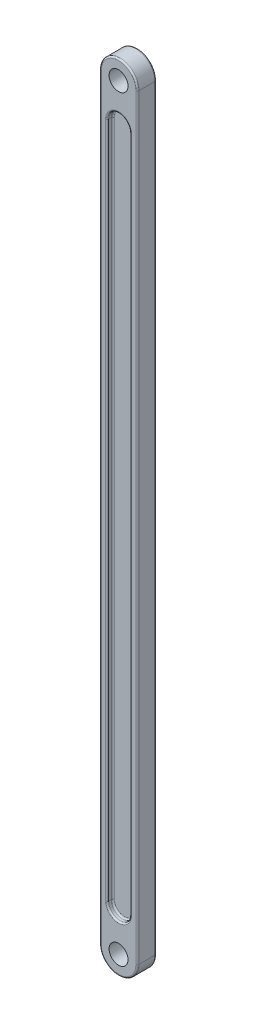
ISO-10303-21;
HEADER;
FILE_DESCRIPTION(('STEP AP214'),'2;1');
FILE_NAME('part.step','',(''),(''),'','','');
FILE_SCHEMA(('AUTOMOTIVE_DESIGN { 1 0 10303 214 1 1 1 1 }'));
ENDSEC;
DATA;
#1=APPLICATION_CONTEXT('core data for automotive mechanical design processes');
#2=APPLICATION_PROTOCOL_DEFINITION('international standard','automotive_design',2000,#1);
#3=PRODUCT_CONTEXT('',#1,'mechanical');
#4=PRODUCT('Part','Part','',(#3));
#5=PRODUCT_RELATED_PRODUCT_CATEGORY('part','',(#4));
#6=PRODUCT_DEFINITION_FORMATION('','',#4);
#7=PRODUCT_DEFINITION_CONTEXT('part definition',#1,'design');
#8=PRODUCT_DEFINITION('design','',#6,#7);
#9=PRODUCT_DEFINITION_SHAPE('','',#8);
#10=(LENGTH_UNIT() NAMED_UNIT(*) SI_UNIT(.MILLI.,.METRE.));
#11=(NAMED_UNIT(*) PLANE_ANGLE_UNIT() SI_UNIT($,.RADIAN.));
#12=(NAMED_UNIT(*) SI_UNIT($,.STERADIAN.) SOLID_ANGLE_UNIT());
#13=UNCERTAINTY_MEASURE_WITH_UNIT(LENGTH_MEASURE(1.E-05),#10,'distance_accuracy_value','');
#14=(GEOMETRIC_REPRESENTATION_CONTEXT(3) GLOBAL_UNCERTAINTY_ASSIGNED_CONTEXT((#13)) GLOBAL_UNIT_ASSIGNED_CONTEXT((#10,
#11,#12)) REPRESENTATION_CONTEXT('',''));
#15=CARTESIAN_POINT('',(0.,0.,0.));
#16=DIRECTION('',(0.,0.,1.));
#17=DIRECTION('',(1.,0.,0.));
#18=AXIS2_PLACEMENT_3D('',#15,#16,#17);
#19=CARTESIAN_POINT('',(0.,1000.,12.5));
#20=DIRECTION('',(0.,0.,1.));
#21=DIRECTION('',(1.,0.,0.));
#22=AXIS2_PLACEMENT_3D('',#19,#20,#21);
#23=PLANE('',#22);
#24=DIRECTION('',(0.,-1.,0.));
#25=VECTOR('',#24,1.);
#26=CARTESIAN_POINT('',(-17.,947.5,12.5));
#27=LINE('',#26,#25);
#28=CARTESIAN_POINT('',(-17.0000000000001,52.5000000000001,12.5));
#29=VERTEX_POINT('',#28);
#30=CARTESIAN_POINT('',(-17.,947.5,12.5));
#31=VERTEX_POINT('',#30);
#32=EDGE_CURVE('E294',#29,#31,#27,.F.);
#33=ORIENTED_EDGE('',*,*,#32,.T.);
#34=CARTESIAN_POINT('',(0.,947.5,12.5));
#35=DIRECTION('',(0.,0.,1.));
#36=DIRECTION('',(1.,0.,0.));
#37=AXIS2_PLACEMENT_3D('',#34,#35,#36);
#38=CIRCLE('',#37,17.0000000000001);
#39=CARTESIAN_POINT('',(17.0000000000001,947.5,12.5));
#40=VERTEX_POINT('',#39);
#41=EDGE_CURVE('E296',#31,#40,#38,.F.);
#42=ORIENTED_EDGE('',*,*,#41,.T.);
#43=DIRECTION('',(0.,-1.,0.));
#44=VECTOR('',#43,1.);
#45=CARTESIAN_POINT('',(17.0000000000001,1000.,12.5));
#46=LINE('',#45,#44);
#47=CARTESIAN_POINT('',(17.0000000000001,52.5000000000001,12.5));
#48=VERTEX_POINT('',#47);
#49=EDGE_CURVE('E290',#40,#48,#46,.T.);
#50=ORIENTED_EDGE('',*,*,#49,.T.);
#51=CARTESIAN_POINT('',(0.,52.5000000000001,12.5));
#52=DIRECTION('',(0.,0.,1.));
#53=DIRECTION('',(1.,0.,0.));
#54=AXIS2_PLACEMENT_3D('',#51,#52,#53);
#55=CIRCLE('',#54,17.0000000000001);
#56=EDGE_CURVE('E292',#48,#29,#55,.F.);
#57=ORIENTED_EDGE('',*,*,#56,.T.);
#58=EDGE_LOOP('',(#33,#42,#50,#57));
#59=FACE_BOUND('',#58,.T.);
#60=CARTESIAN_POINT('',(0.,1000.,12.5));
#61=DIRECTION('',(0.,0.,1.));
#62=DIRECTION('',(1.,0.,0.));
#63=AXIS2_PLACEMENT_3D('',#60,#61,#62);
#64=CIRCLE('',#63,12.5);
#65=CARTESIAN_POINT('',(12.5,1000.,12.5));
#66=VERTEX_POINT('',#65);
#67=EDGE_CURVE('E402',#66,#66,#64,.T.);
#68=ORIENTED_EDGE('',*,*,#67,.F.);
#69=EDGE_LOOP('',(#68));
#70=FACE_BOUND('',#69,.T.);
#71=CARTESIAN_POINT('',(0.,0.,12.5));
#72=DIRECTION('',(0.,0.,1.));
#73=DIRECTION('',(1.,0.,0.));
#74=AXIS2_PLACEMENT_3D('',#71,#72,#73);
#75=CIRCLE('',#74,12.5);
#76=CARTESIAN_POINT('',(12.5,0.,12.5));
#77=VERTEX_POINT('',#76);
#78=EDGE_CURVE('E408',#77,#77,#75,.T.);
#79=ORIENTED_EDGE('',*,*,#78,.F.);
#80=EDGE_LOOP('',(#79));
#81=FACE_BOUND('',#80,.T.);
#82=DIRECTION('',(0.,1.,0.));
#83=VECTOR('',#82,1.);
#84=CARTESIAN_POINT('',(23.,1000.,12.5));
#85=LINE('',#84,#83);
#86=CARTESIAN_POINT('',(23.,0.,12.5));
#87=VERTEX_POINT('',#86);
#88=CARTESIAN_POINT('',(23.,1000.,12.5));
#89=VERTEX_POINT('',#88);
#90=EDGE_CURVE('E220',#87,#89,#85,.T.);
#91=ORIENTED_EDGE('',*,*,#90,.T.);
#92=CARTESIAN_POINT('',(0.,1000.,12.5));
#93=DIRECTION('',(0.,0.,1.));
#94=DIRECTION('',(1.,0.,0.));
#95=AXIS2_PLACEMENT_3D('',#92,#93,#94);
#96=CIRCLE('',#95,23.);
#97=CARTESIAN_POINT('',(-23.0000000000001,1000.,12.5));
#98=VERTEX_POINT('',#97);
#99=EDGE_CURVE('E201',#89,#98,#96,.T.);
#100=ORIENTED_EDGE('',*,*,#99,.T.);
#101=DIRECTION('',(0.,-1.,0.));
#102=VECTOR('',#101,1.);
#103=CARTESIAN_POINT('',(-23.,0.,12.5));
#104=LINE('',#103,#102);
#105=CARTESIAN_POINT('',(-23.,0.,12.5));
#106=VERTEX_POINT('',#105);
#107=EDGE_CURVE('E210',#98,#106,#104,.T.);
#108=ORIENTED_EDGE('',*,*,#107,.T.);
#109=CARTESIAN_POINT('',(0.,0.,12.5));
#110=DIRECTION('',(0.,0.,1.));
#111=DIRECTION('',(1.,0.,0.));
#112=AXIS2_PLACEMENT_3D('',#109,#110,#111);
#113=CIRCLE('',#112,23.);
#114=EDGE_CURVE('E216',#106,#87,#113,.T.);
#115=ORIENTED_EDGE('',*,*,#114,.T.);
#116=EDGE_LOOP('',(#91,#100,#108,#115));
#117=FACE_BOUND('',#116,.T.);
#118=ADVANCED_FACE('F34',(#59,#70,#81,#117),#23,.T.);
#119=CARTESIAN_POINT('',(0.,1000.,-12.5));
#120=DIRECTION('',(0.,0.,1.));
#121=DIRECTION('',(1.,0.,0.));
#122=AXIS2_PLACEMENT_3D('',#119,#120,#121);
#123=PLANE('',#122);
#124=DIRECTION('',(0.,1.,0.));
#125=VECTOR('',#124,1.);
#126=CARTESIAN_POINT('',(-17.0000000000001,52.5000000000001,-12.5));
#127=LINE('',#126,#125);
#128=CARTESIAN_POINT('',(-17.,947.5,-12.5));
#129=VERTEX_POINT('',#128);
#130=CARTESIAN_POINT('',(-17.0000000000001,52.5000000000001,-12.5));
#131=VERTEX_POINT('',#130);
#132=EDGE_CURVE('E51',#129,#131,#127,.F.);
#133=ORIENTED_EDGE('',*,*,#132,.T.);
#134=CARTESIAN_POINT('',(0.,52.5000000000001,-12.5));
#135=DIRECTION('',(0.,0.,1.));
#136=DIRECTION('',(1.,0.,0.));
#137=AXIS2_PLACEMENT_3D('',#134,#135,#136);
#138=CIRCLE('',#137,17.0000000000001);
#139=CARTESIAN_POINT('',(17.0000000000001,52.5000000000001,-12.5));
#140=VERTEX_POINT('',#139);
#141=EDGE_CURVE('E326',#131,#140,#138,.T.);
#142=ORIENTED_EDGE('',*,*,#141,.T.);
#143=DIRECTION('',(0.,1.,0.));
#144=VECTOR('',#143,1.);
#145=CARTESIAN_POINT('',(17.0000000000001,1000.,-12.5));
#146=LINE('',#145,#144);
#147=CARTESIAN_POINT('',(17.0000000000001,947.5,-12.5));
#148=VERTEX_POINT('',#147);
#149=EDGE_CURVE('E322',#140,#148,#146,.T.);
#150=ORIENTED_EDGE('',*,*,#149,.T.);
#151=CARTESIAN_POINT('',(0.,947.5,-12.5));
#152=DIRECTION('',(0.,0.,1.));
#153=DIRECTION('',(1.,0.,0.));
#154=AXIS2_PLACEMENT_3D('',#151,#152,#153);
#155=CIRCLE('',#154,17.0000000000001);
#156=EDGE_CURVE('E56',#148,#129,#155,.T.);
#157=ORIENTED_EDGE('',*,*,#156,.T.);
#158=EDGE_LOOP('',(#133,#142,#150,#157));
#159=FACE_BOUND('',#158,.T.);
#160=DIRECTION('',(0.,-1.,0.));
#161=VECTOR('',#160,1.);
#162=CARTESIAN_POINT('',(-23.0000000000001,1000.,-12.5));
#163=LINE('',#162,#161);
#164=CARTESIAN_POINT('',(-23.,0.,-12.5));
#165=VERTEX_POINT('',#164);
#166=CARTESIAN_POINT('',(-23.0000000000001,1000.,-12.5));
#167=VERTEX_POINT('',#166);
#168=EDGE_CURVE('E238',#165,#167,#163,.F.);
#169=ORIENTED_EDGE('',*,*,#168,.T.);
#170=CARTESIAN_POINT('',(0.,1000.,-12.5));
#171=DIRECTION('',(0.,0.,1.));
#172=DIRECTION('',(1.,0.,0.));
#173=AXIS2_PLACEMENT_3D('',#170,#171,#172);
#174=CIRCLE('',#173,23.);
#175=CARTESIAN_POINT('',(23.,1000.,-12.5));
#176=VERTEX_POINT('',#175);
#177=EDGE_CURVE('E244',#167,#176,#174,.F.);
#178=ORIENTED_EDGE('',*,*,#177,.T.);
#179=DIRECTION('',(0.,1.,0.));
#180=VECTOR('',#179,1.);
#181=CARTESIAN_POINT('',(23.,1000.,-12.5));
#182=LINE('',#181,#180);
#183=CARTESIAN_POINT('',(23.,0.,-12.5));
#184=VERTEX_POINT('',#183);
#185=EDGE_CURVE('E242',#176,#184,#182,.F.);
#186=ORIENTED_EDGE('',*,*,#185,.T.);
#187=CARTESIAN_POINT('',(0.,0.,-12.5));
#188=DIRECTION('',(0.,0.,1.));
#189=DIRECTION('',(1.,0.,0.));
#190=AXIS2_PLACEMENT_3D('',#187,#188,#189);
#191=CIRCLE('',#190,23.);
#192=EDGE_CURVE('E240',#184,#165,#191,.F.);
#193=ORIENTED_EDGE('',*,*,#192,.T.);
#194=EDGE_LOOP('',(#169,#178,#186,#193));
#195=FACE_BOUND('',#194,.T.);
#196=CARTESIAN_POINT('',(0.,0.,-12.5));
#197=DIRECTION('',(0.,0.,1.));
#198=DIRECTION('',(1.,0.,0.));
#199=AXIS2_PLACEMENT_3D('',#196,#197,#198);
#200=CIRCLE('',#199,12.5);
#201=CARTESIAN_POINT('',(12.5,0.,-12.5));
#202=VERTEX_POINT('',#201);
#203=EDGE_CURVE('E405',#202,#202,#200,.T.);
#204=ORIENTED_EDGE('',*,*,#203,.T.);
#205=EDGE_LOOP('',(#204));
#206=FACE_BOUND('',#205,.T.);
#207=CARTESIAN_POINT('',(0.,1000.,-12.5));
#208=DIRECTION('',(0.,0.,1.));
#209=DIRECTION('',(1.,0.,0.));
#210=AXIS2_PLACEMENT_3D('',#207,#208,#209);
#211=CIRCLE('',#210,12.5);
#212=CARTESIAN_POINT('',(12.5,1000.,-12.5));
#213=VERTEX_POINT('',#212);
#214=EDGE_CURVE('E257',#213,#213,#211,.T.);
#215=ORIENTED_EDGE('',*,*,#214,.T.);
#216=EDGE_LOOP('',(#215));
#217=FACE_BOUND('',#216,.T.);
#218=ADVANCED_FACE('F463',(#159,#195,#206,#217),#123,.F.);
#219=CARTESIAN_POINT('',(0.,1000.,12.5));
#220=DIRECTION('',(0.,0.,-1.));
#221=DIRECTION('',(-1.,0.,0.));
#222=AXIS2_PLACEMENT_3D('',#219,#220,#221);
#223=CYLINDRICAL_SURFACE('',#222,25.);
#224=DIRECTION('',(0.,0.,-1.));
#225=VECTOR('',#224,1.);
#226=CARTESIAN_POINT('',(-25.0000000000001,1000.,12.5));
#227=LINE('',#226,#225);
#228=CARTESIAN_POINT('',(-25.0000000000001,1000.,10.5));
#229=VERTEX_POINT('',#228);
#230=CARTESIAN_POINT('',(-25.0000000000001,1000.,-10.5));
#231=VERTEX_POINT('',#230);
#232=EDGE_CURVE('E217',#229,#231,#227,.T.);
#233=ORIENTED_EDGE('',*,*,#232,.F.);
#234=CARTESIAN_POINT('',(0.,1000.,10.5));
#235=DIRECTION('',(0.,0.,1.));
#236=DIRECTION('',(1.,0.,0.));
#237=AXIS2_PLACEMENT_3D('',#234,#235,#236);
#238=CIRCLE('',#237,25.);
#239=CARTESIAN_POINT('',(25.,1000.,10.5));
#240=VERTEX_POINT('',#239);
#241=EDGE_CURVE('E203',#229,#240,#238,.F.);
#242=ORIENTED_EDGE('',*,*,#241,.T.);
#243=DIRECTION('',(0.,0.,-1.));
#244=VECTOR('',#243,1.);
#245=CARTESIAN_POINT('',(25.,1000.,12.5));
#246=LINE('',#245,#244);
#247=CARTESIAN_POINT('',(25.,1000.,-10.5));
#248=VERTEX_POINT('',#247);
#249=EDGE_CURVE('E411',#240,#248,#246,.T.);
#250=ORIENTED_EDGE('',*,*,#249,.T.);
#251=CARTESIAN_POINT('',(0.,1000.,-10.5));
#252=DIRECTION('',(0.,0.,1.));
#253=DIRECTION('',(1.,0.,0.));
#254=AXIS2_PLACEMENT_3D('',#251,#252,#253);
#255=CIRCLE('',#254,25.);
#256=EDGE_CURVE('E222',#248,#231,#255,.T.);
#257=ORIENTED_EDGE('',*,*,#256,.T.);
#258=EDGE_LOOP('',(#233,#242,#250,#257));
#259=FACE_BOUND('',#258,.T.);
#260=ADVANCED_FACE('F435',(#259),#223,.T.);
#261=CARTESIAN_POINT('',(-25.0000000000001,1000.,12.5));
#262=DIRECTION('',(1.,0.,0.));
#263=DIRECTION('',(0.,1.,0.));
#264=AXIS2_PLACEMENT_3D('',#261,#262,#263);
#265=PLANE('',#264);
#266=DIRECTION('',(0.,0.,-1.));
#267=VECTOR('',#266,1.);
#268=CARTESIAN_POINT('',(-25.,0.,12.5));
#269=LINE('',#268,#267);
#270=CARTESIAN_POINT('',(-25.,0.,10.5));
#271=VERTEX_POINT('',#270);
#272=CARTESIAN_POINT('',(-25.,0.,-10.5));
#273=VERTEX_POINT('',#272);
#274=EDGE_CURVE('E419',#271,#273,#269,.T.);
#275=ORIENTED_EDGE('',*,*,#274,.F.);
#276=DIRECTION('',(0.,-1.,0.));
#277=VECTOR('',#276,1.);
#278=CARTESIAN_POINT('',(-25.0000000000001,1000.,10.5));
#279=LINE('',#278,#277);
#280=EDGE_CURVE('E249',#271,#229,#279,.F.);
#281=ORIENTED_EDGE('',*,*,#280,.T.);
#282=ORIENTED_EDGE('',*,*,#232,.T.);
#283=DIRECTION('',(0.,-1.,0.));
#284=VECTOR('',#283,1.);
#285=CARTESIAN_POINT('',(-25.0000000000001,1000.,-10.5));
#286=LINE('',#285,#284);
#287=EDGE_CURVE('E247',#231,#273,#286,.T.);
#288=ORIENTED_EDGE('',*,*,#287,.T.);
#289=EDGE_LOOP('',(#275,#281,#282,#288));
#290=FACE_BOUND('',#289,.T.);
#291=ADVANCED_FACE('F451',(#290),#265,.F.);
#292=CARTESIAN_POINT('',(0.,0.,12.5));
#293=DIRECTION('',(0.,0.,-1.));
#294=DIRECTION('',(-1.,0.,0.));
#295=AXIS2_PLACEMENT_3D('',#292,#293,#294);
#296=CYLINDRICAL_SURFACE('',#295,25.);
#297=DIRECTION('',(0.,0.,-1.));
#298=VECTOR('',#297,1.);
#299=CARTESIAN_POINT('',(25.,0.,12.5));
#300=LINE('',#299,#298);
#301=CARTESIAN_POINT('',(25.,0.,10.5));
#302=VERTEX_POINT('',#301);
#303=CARTESIAN_POINT('',(25.,0.,-10.5));
#304=VERTEX_POINT('',#303);
#305=EDGE_CURVE('E416',#302,#304,#300,.T.);
#306=ORIENTED_EDGE('',*,*,#305,.F.);
#307=CARTESIAN_POINT('',(0.,0.,10.5));
#308=DIRECTION('',(0.,0.,1.));
#309=DIRECTION('',(1.,0.,0.));
#310=AXIS2_PLACEMENT_3D('',#307,#308,#309);
#311=CIRCLE('',#310,25.);
#312=EDGE_CURVE('E236',#302,#271,#311,.F.);
#313=ORIENTED_EDGE('',*,*,#312,.T.);
#314=ORIENTED_EDGE('',*,*,#274,.T.);
#315=CARTESIAN_POINT('',(0.,0.,-10.5));
#316=DIRECTION('',(0.,0.,1.));
#317=DIRECTION('',(1.,0.,0.));
#318=AXIS2_PLACEMENT_3D('',#315,#316,#317);
#319=CIRCLE('',#318,25.);
#320=EDGE_CURVE('E234',#273,#304,#319,.T.);
#321=ORIENTED_EDGE('',*,*,#320,.T.);
#322=EDGE_LOOP('',(#306,#313,#314,#321));
#323=FACE_BOUND('',#322,.T.);
#324=ADVANCED_FACE('F454',(#323),#296,.T.);
#325=CARTESIAN_POINT('',(25.,1000.,12.5));
#326=DIRECTION('',(-1.,0.,0.));
#327=DIRECTION('',(0.,-1.,0.));
#328=AXIS2_PLACEMENT_3D('',#325,#326,#327);
#329=PLANE('',#328);
#330=ORIENTED_EDGE('',*,*,#249,.F.);
#331=DIRECTION('',(0.,1.,0.));
#332=VECTOR('',#331,1.);
#333=CARTESIAN_POINT('',(25.,0.,10.5));
#334=LINE('',#333,#332);
#335=EDGE_CURVE('E232',#240,#302,#334,.F.);
#336=ORIENTED_EDGE('',*,*,#335,.T.);
#337=ORIENTED_EDGE('',*,*,#305,.T.);
#338=DIRECTION('',(0.,1.,0.));
#339=VECTOR('',#338,1.);
#340=CARTESIAN_POINT('',(25.,1000.,-10.5));
#341=LINE('',#340,#339);
#342=EDGE_CURVE('E230',#304,#248,#341,.T.);
#343=ORIENTED_EDGE('',*,*,#342,.T.);
#344=EDGE_LOOP('',(#330,#336,#337,#343));
#345=FACE_BOUND('',#344,.T.);
#346=ADVANCED_FACE('F437',(#345),#329,.F.);
#347=CARTESIAN_POINT('',(0.,0.,12.5));
#348=DIRECTION('',(0.,0.,-1.));
#349=DIRECTION('',(-1.,0.,0.));
#350=AXIS2_PLACEMENT_3D('',#347,#348,#349);
#351=CYLINDRICAL_SURFACE('',#350,12.5);
#352=ORIENTED_EDGE('',*,*,#78,.T.);
#353=EDGE_LOOP('',(#352));
#354=FACE_BOUND('',#353,.T.);
#355=ORIENTED_EDGE('',*,*,#203,.F.);
#356=EDGE_LOOP('',(#355));
#357=FACE_BOUND('',#356,.T.);
#358=ADVANCED_FACE('F473',(#354,#357),#351,.F.);
#359=CARTESIAN_POINT('',(0.,1000.,12.5));
#360=DIRECTION('',(0.,0.,-1.));
#361=DIRECTION('',(-1.,0.,0.));
#362=AXIS2_PLACEMENT_3D('',#359,#360,#361);
#363=CYLINDRICAL_SURFACE('',#362,12.5);
#364=ORIENTED_EDGE('',*,*,#67,.T.);
#365=EDGE_LOOP('',(#364));
#366=FACE_BOUND('',#365,.T.);
#367=ORIENTED_EDGE('',*,*,#214,.F.);
#368=EDGE_LOOP('',(#367));
#369=FACE_BOUND('',#368,.T.);
#370=ADVANCED_FACE('F471',(#366,#369),#363,.F.);
#371=CARTESIAN_POINT('',(0.,0.,10.5));
#372=DIRECTION('',(0.,0.,1.));
#373=DIRECTION('',(1.,0.,0.));
#374=AXIS2_PLACEMENT_3D('',#371,#372,#373);
#375=TOROIDAL_SURFACE('',#374,23.,2.);
#376=CARTESIAN_POINT('',(-23.,0.,10.5));
#377=DIRECTION('',(0.,1.,0.));
#378=DIRECTION('',(-1.,0.,0.));
#379=AXIS2_PLACEMENT_3D('',#376,#377,#378);
#380=CIRCLE('',#379,2.);
#381=EDGE_CURVE('E213',#271,#106,#380,.T.);
#382=ORIENTED_EDGE('',*,*,#381,.F.);
#383=ORIENTED_EDGE('',*,*,#312,.F.);
#384=CARTESIAN_POINT('',(23.,0.,10.5));
#385=DIRECTION('',(0.,1.,0.));
#386=DIRECTION('',(-1.,0.,0.));
#387=AXIS2_PLACEMENT_3D('',#384,#385,#386);
#388=CIRCLE('',#387,2.);
#389=EDGE_CURVE('E254',#87,#302,#388,.T.);
#390=ORIENTED_EDGE('',*,*,#389,.F.);
#391=ORIENTED_EDGE('',*,*,#114,.F.);
#392=EDGE_LOOP('',(#382,#383,#390,#391));
#393=FACE_BOUND('',#392,.T.);
#394=ADVANCED_FACE('F426',(#393),#375,.T.);
#395=CARTESIAN_POINT('',(23.,1000.,10.5));
#396=DIRECTION('',(0.,-1.,0.));
#397=DIRECTION('',(1.,0.,0.));
#398=AXIS2_PLACEMENT_3D('',#395,#396,#397);
#399=CYLINDRICAL_SURFACE('',#398,2.);
#400=ORIENTED_EDGE('',*,*,#389,.T.);
#401=ORIENTED_EDGE('',*,*,#335,.F.);
#402=CARTESIAN_POINT('',(23.,1000.,10.5));
#403=DIRECTION('',(0.,1.,0.));
#404=DIRECTION('',(0.,0.,1.));
#405=AXIS2_PLACEMENT_3D('',#402,#403,#404);
#406=CIRCLE('',#405,2.);
#407=EDGE_CURVE('E206',#89,#240,#406,.T.);
#408=ORIENTED_EDGE('',*,*,#407,.F.);
#409=ORIENTED_EDGE('',*,*,#90,.F.);
#410=EDGE_LOOP('',(#400,#401,#408,#409));
#411=FACE_BOUND('',#410,.T.);
#412=ADVANCED_FACE('F429',(#411),#399,.T.);
#413=CARTESIAN_POINT('',(-23.0000000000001,1000.,10.5));
#414=DIRECTION('',(0.,1.,0.));
#415=DIRECTION('',(-1.,0.,0.));
#416=AXIS2_PLACEMENT_3D('',#413,#414,#415);
#417=CYLINDRICAL_SURFACE('',#416,2.);
#418=ORIENTED_EDGE('',*,*,#381,.T.);
#419=ORIENTED_EDGE('',*,*,#107,.F.);
#420=CARTESIAN_POINT('',(-23.0000000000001,1000.,10.5));
#421=DIRECTION('',(0.,1.,0.));
#422=DIRECTION('',(0.,0.,1.));
#423=AXIS2_PLACEMENT_3D('',#420,#421,#422);
#424=CIRCLE('',#423,2.);
#425=EDGE_CURVE('E197',#229,#98,#424,.T.);
#426=ORIENTED_EDGE('',*,*,#425,.F.);
#427=ORIENTED_EDGE('',*,*,#280,.F.);
#428=EDGE_LOOP('',(#418,#419,#426,#427));
#429=FACE_BOUND('',#428,.T.);
#430=ADVANCED_FACE('F211',(#429),#417,.T.);
#431=CARTESIAN_POINT('',(0.,1000.,10.5));
#432=DIRECTION('',(0.,0.,1.));
#433=DIRECTION('',(1.,0.,0.));
#434=AXIS2_PLACEMENT_3D('',#431,#432,#433);
#435=TOROIDAL_SURFACE('',#434,23.,2.);
#436=ORIENTED_EDGE('',*,*,#407,.T.);
#437=ORIENTED_EDGE('',*,*,#241,.F.);
#438=ORIENTED_EDGE('',*,*,#425,.T.);
#439=ORIENTED_EDGE('',*,*,#99,.F.);
#440=EDGE_LOOP('',(#436,#437,#438,#439));
#441=FACE_BOUND('',#440,.T.);
#442=ADVANCED_FACE('F199',(#441),#435,.T.);
#443=CARTESIAN_POINT('',(0.,0.,-10.5));
#444=DIRECTION('',(0.,0.,1.));
#445=DIRECTION('',(1.,0.,0.));
#446=AXIS2_PLACEMENT_3D('',#443,#444,#445);
#447=TOROIDAL_SURFACE('',#446,23.,2.);
#448=CARTESIAN_POINT('',(-23.,0.,-10.5));
#449=DIRECTION('',(0.,1.,0.));
#450=DIRECTION('',(-1.,0.,0.));
#451=AXIS2_PLACEMENT_3D('',#448,#449,#450);
#452=CIRCLE('',#451,2.);
#453=EDGE_CURVE('E263',#165,#273,#452,.T.);
#454=ORIENTED_EDGE('',*,*,#453,.F.);
#455=ORIENTED_EDGE('',*,*,#192,.F.);
#456=CARTESIAN_POINT('',(23.,0.,-10.5));
#457=DIRECTION('',(0.,1.,0.));
#458=DIRECTION('',(0.,0.,1.));
#459=AXIS2_PLACEMENT_3D('',#456,#457,#458);
#460=CIRCLE('',#459,2.);
#461=EDGE_CURVE('E207',#304,#184,#460,.T.);
#462=ORIENTED_EDGE('',*,*,#461,.F.);
#463=ORIENTED_EDGE('',*,*,#320,.F.);
#464=EDGE_LOOP('',(#454,#455,#462,#463));
#465=FACE_BOUND('',#464,.T.);
#466=ADVANCED_FACE('F457',(#465),#447,.T.);
#467=CARTESIAN_POINT('',(23.,1000.,-10.5));
#468=DIRECTION('',(0.,1.,0.));
#469=DIRECTION('',(-1.,0.,0.));
#470=AXIS2_PLACEMENT_3D('',#467,#468,#469);
#471=CYLINDRICAL_SURFACE('',#470,2.);
#472=ORIENTED_EDGE('',*,*,#461,.T.);
#473=ORIENTED_EDGE('',*,*,#185,.F.);
#474=CARTESIAN_POINT('',(23.,1000.,-10.5));
#475=DIRECTION('',(0.,1.,0.));
#476=DIRECTION('',(0.,0.,1.));
#477=AXIS2_PLACEMENT_3D('',#474,#475,#476);
#478=CIRCLE('',#477,2.);
#479=EDGE_CURVE('E260',#248,#176,#478,.T.);
#480=ORIENTED_EDGE('',*,*,#479,.F.);
#481=ORIENTED_EDGE('',*,*,#342,.F.);
#482=EDGE_LOOP('',(#472,#473,#480,#481));
#483=FACE_BOUND('',#482,.T.);
#484=ADVANCED_FACE('F441',(#483),#471,.T.);
#485=CARTESIAN_POINT('',(-23.0000000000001,1000.,-10.5));
#486=DIRECTION('',(0.,-1.,0.));
#487=DIRECTION('',(1.,0.,0.));
#488=AXIS2_PLACEMENT_3D('',#485,#486,#487);
#489=CYLINDRICAL_SURFACE('',#488,2.);
#490=ORIENTED_EDGE('',*,*,#453,.T.);
#491=ORIENTED_EDGE('',*,*,#287,.F.);
#492=CARTESIAN_POINT('',(-23.0000000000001,1000.,-10.5));
#493=DIRECTION('',(0.,1.,0.));
#494=DIRECTION('',(0.,0.,1.));
#495=AXIS2_PLACEMENT_3D('',#492,#493,#494);
#496=CIRCLE('',#495,2.);
#497=EDGE_CURVE('E258',#167,#231,#496,.T.);
#498=ORIENTED_EDGE('',*,*,#497,.F.);
#499=ORIENTED_EDGE('',*,*,#168,.F.);
#500=EDGE_LOOP('',(#490,#491,#498,#499));
#501=FACE_BOUND('',#500,.T.);
#502=ADVANCED_FACE('F461',(#501),#489,.T.);
#503=CARTESIAN_POINT('',(0.,1000.,-10.5));
#504=DIRECTION('',(0.,0.,1.));
#505=DIRECTION('',(1.,0.,0.));
#506=AXIS2_PLACEMENT_3D('',#503,#504,#505);
#507=TOROIDAL_SURFACE('',#506,23.,2.);
#508=ORIENTED_EDGE('',*,*,#479,.T.);
#509=ORIENTED_EDGE('',*,*,#177,.F.);
#510=ORIENTED_EDGE('',*,*,#497,.T.);
#511=ORIENTED_EDGE('',*,*,#256,.F.);
#512=EDGE_LOOP('',(#508,#509,#510,#511));
#513=FACE_BOUND('',#512,.T.);
#514=ADVANCED_FACE('F446',(#513),#507,.T.);
#515=CARTESIAN_POINT('',(0.,947.5,-5.));
#516=DIRECTION('',(0.,0.,-1.));
#517=DIRECTION('',(-1.,0.,0.));
#518=AXIS2_PLACEMENT_3D('',#515,#516,#517);
#519=CYLINDRICAL_SURFACE('',#518,15.0000000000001);
#520=DIRECTION('',(0.,0.,-1.));
#521=VECTOR('',#520,1.);
#522=CARTESIAN_POINT('',(15.0000000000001,947.5,-5.));
#523=LINE('',#522,#521);
#524=CARTESIAN_POINT('',(15.0000000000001,947.5,-7.));
#525=VERTEX_POINT('',#524);
#526=CARTESIAN_POINT('',(15.0000000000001,947.5,-10.5));
#527=VERTEX_POINT('',#526);
#528=EDGE_CURVE('E384',#525,#527,#523,.T.);
#529=ORIENTED_EDGE('',*,*,#528,.F.);
#530=CARTESIAN_POINT('',(0.,947.5,-7.));
#531=DIRECTION('',(0.,0.,-1.));
#532=DIRECTION('',(-1.,0.,0.));
#533=AXIS2_PLACEMENT_3D('',#530,#531,#532);
#534=CIRCLE('',#533,15.0000000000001);
#535=CARTESIAN_POINT('',(-15.,947.5,-7.));
#536=VERTEX_POINT('',#535);
#537=EDGE_CURVE('E310',#525,#536,#534,.F.);
#538=ORIENTED_EDGE('',*,*,#537,.T.);
#539=DIRECTION('',(0.,0.,-1.));
#540=VECTOR('',#539,1.);
#541=CARTESIAN_POINT('',(-15.,947.5,-5.));
#542=LINE('',#541,#540);
#543=CARTESIAN_POINT('',(-15.,947.5,-10.5));
#544=VERTEX_POINT('',#543);
#545=EDGE_CURVE('E261',#536,#544,#542,.T.);
#546=ORIENTED_EDGE('',*,*,#545,.T.);
#547=CARTESIAN_POINT('',(0.,947.5,-10.5));
#548=DIRECTION('',(0.,0.,1.));
#549=DIRECTION('',(1.,0.,0.));
#550=AXIS2_PLACEMENT_3D('',#547,#548,#549);
#551=CIRCLE('',#550,15.0000000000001);
#552=EDGE_CURVE('E308',#544,#527,#551,.F.);
#553=ORIENTED_EDGE('',*,*,#552,.T.);
#554=EDGE_LOOP('',(#529,#538,#546,#553));
#555=FACE_BOUND('',#554,.T.);
#556=ADVANCED_FACE('F383',(#555),#519,.F.);
#557=CARTESIAN_POINT('',(-15.,947.5,-5.));
#558=DIRECTION('',(1.,0.,0.));
#559=DIRECTION('',(0.,1.,0.));
#560=AXIS2_PLACEMENT_3D('',#557,#558,#559);
#561=PLANE('',#560);
#562=ORIENTED_EDGE('',*,*,#545,.F.);
#563=DIRECTION('',(0.,-1.,0.));
#564=VECTOR('',#563,1.);
#565=CARTESIAN_POINT('',(-15.0000000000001,52.5000000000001,-7.));
#566=LINE('',#565,#564);
#567=CARTESIAN_POINT('',(-15.0000000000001,52.5000000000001,-7.));
#568=VERTEX_POINT('',#567);
#569=EDGE_CURVE('E315',#536,#568,#566,.T.);
#570=ORIENTED_EDGE('',*,*,#569,.T.);
#571=DIRECTION('',(0.,0.,-1.));
#572=VECTOR('',#571,1.);
#573=CARTESIAN_POINT('',(-15.0000000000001,52.5000000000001,-5.));
#574=LINE('',#573,#572);
#575=CARTESIAN_POINT('',(-15.0000000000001,52.5000000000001,-10.5));
#576=VERTEX_POINT('',#575);
#577=EDGE_CURVE('E395',#568,#576,#574,.T.);
#578=ORIENTED_EDGE('',*,*,#577,.T.);
#579=DIRECTION('',(0.,1.,0.));
#580=VECTOR('',#579,1.);
#581=CARTESIAN_POINT('',(-15.,947.5,-10.5));
#582=LINE('',#581,#580);
#583=EDGE_CURVE('E313',#576,#544,#582,.T.);
#584=ORIENTED_EDGE('',*,*,#583,.T.);
#585=EDGE_LOOP('',(#562,#570,#578,#584));
#586=FACE_BOUND('',#585,.T.);
#587=ADVANCED_FACE('F682',(#586),#561,.T.);
#588=CARTESIAN_POINT('',(0.,52.5000000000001,-5.));
#589=DIRECTION('',(0.,0.,-1.));
#590=DIRECTION('',(-1.,0.,0.));
#591=AXIS2_PLACEMENT_3D('',#588,#589,#590);
#592=CYLINDRICAL_SURFACE('',#591,15.0000000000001);
#593=ORIENTED_EDGE('',*,*,#577,.F.);
#594=CARTESIAN_POINT('',(0.,52.5000000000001,-7.));
#595=DIRECTION('',(0.,0.,-1.));
#596=DIRECTION('',(-1.,0.,0.));
#597=AXIS2_PLACEMENT_3D('',#594,#595,#596);
#598=CIRCLE('',#597,15.0000000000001);
#599=CARTESIAN_POINT('',(15.0000000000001,52.5000000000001,-7.));
#600=VERTEX_POINT('',#599);
#601=EDGE_CURVE('E320',#568,#600,#598,.F.);
#602=ORIENTED_EDGE('',*,*,#601,.T.);
#603=DIRECTION('',(0.,0.,-1.));
#604=VECTOR('',#603,1.);
#605=CARTESIAN_POINT('',(15.0000000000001,52.5000000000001,-5.));
#606=LINE('',#605,#604);
#607=CARTESIAN_POINT('',(15.0000000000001,52.5000000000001,-10.5));
#608=VERTEX_POINT('',#607);
#609=EDGE_CURVE('E392',#600,#608,#606,.T.);
#610=ORIENTED_EDGE('',*,*,#609,.T.);
#611=CARTESIAN_POINT('',(0.,52.5000000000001,-10.5));
#612=DIRECTION('',(0.,0.,1.));
#613=DIRECTION('',(1.,0.,0.));
#614=AXIS2_PLACEMENT_3D('',#611,#612,#613);
#615=CIRCLE('',#614,15.0000000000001);
#616=EDGE_CURVE('E317',#608,#576,#615,.F.);
#617=ORIENTED_EDGE('',*,*,#616,.T.);
#618=EDGE_LOOP('',(#593,#602,#610,#617));
#619=FACE_BOUND('',#618,.T.);
#620=ADVANCED_FACE('F675',(#619),#592,.F.);
#621=CARTESIAN_POINT('',(15.0000000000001,947.5,-5.));
#622=DIRECTION('',(1.,0.,0.));
#623=DIRECTION('',(0.,1.,0.));
#624=AXIS2_PLACEMENT_3D('',#621,#622,#623);
#625=PLANE('',#624);
#626=ORIENTED_EDGE('',*,*,#609,.F.);
#627=DIRECTION('',(0.,-1.,0.));
#628=VECTOR('',#627,1.);
#629=CARTESIAN_POINT('',(15.0000000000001,947.5,-7.));
#630=LINE('',#629,#628);
#631=EDGE_CURVE('E11',#600,#525,#630,.F.);
#632=ORIENTED_EDGE('',*,*,#631,.T.);
#633=ORIENTED_EDGE('',*,*,#528,.T.);
#634=DIRECTION('',(0.,1.,0.));
#635=VECTOR('',#634,1.);
#636=CARTESIAN_POINT('',(15.0000000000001,947.5,-10.5));
#637=LINE('',#636,#635);
#638=EDGE_CURVE('E43',#527,#608,#637,.F.);
#639=ORIENTED_EDGE('',*,*,#638,.T.);
#640=EDGE_LOOP('',(#626,#632,#633,#639));
#641=FACE_BOUND('',#640,.T.);
#642=ADVANCED_FACE('F389',(#641),#625,.F.);
#643=CARTESIAN_POINT('',(0.,947.5,-5.));
#644=DIRECTION('',(0.,0.,-1.));
#645=DIRECTION('',(-1.,0.,0.));
#646=AXIS2_PLACEMENT_3D('',#643,#644,#645);
#647=PLANE('',#646);
#648=DIRECTION('',(0.,-1.,0.));
#649=VECTOR('',#648,1.);
#650=CARTESIAN_POINT('',(-13.,947.5,-5.));
#651=LINE('',#650,#649);
#652=CARTESIAN_POINT('',(-13.0000000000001,52.5000000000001,-5.));
#653=VERTEX_POINT('',#652);
#654=CARTESIAN_POINT('',(-13.,947.5,-5.));
#655=VERTEX_POINT('',#654);
#656=EDGE_CURVE('E303',#653,#655,#651,.F.);
#657=ORIENTED_EDGE('',*,*,#656,.T.);
#658=CARTESIAN_POINT('',(0.,947.5,-5.));
#659=DIRECTION('',(0.,0.,-1.));
#660=DIRECTION('',(-1.,0.,0.));
#661=AXIS2_PLACEMENT_3D('',#658,#659,#660);
#662=CIRCLE('',#661,13.0000000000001);
#663=CARTESIAN_POINT('',(13.0000000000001,947.5,-5.));
#664=VERTEX_POINT('',#663);
#665=EDGE_CURVE('E305',#655,#664,#662,.T.);
#666=ORIENTED_EDGE('',*,*,#665,.T.);
#667=DIRECTION('',(0.,-1.,0.));
#668=VECTOR('',#667,1.);
#669=CARTESIAN_POINT('',(13.0000000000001,947.5,-5.));
#670=LINE('',#669,#668);
#671=CARTESIAN_POINT('',(13.0000000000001,52.5000000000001,-5.));
#672=VERTEX_POINT('',#671);
#673=EDGE_CURVE('E299',#664,#672,#670,.T.);
#674=ORIENTED_EDGE('',*,*,#673,.T.);
#675=CARTESIAN_POINT('',(0.,52.5000000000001,-5.));
#676=DIRECTION('',(0.,0.,-1.));
#677=DIRECTION('',(-1.,0.,0.));
#678=AXIS2_PLACEMENT_3D('',#675,#676,#677);
#679=CIRCLE('',#678,13.0000000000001);
#680=EDGE_CURVE('E301',#672,#653,#679,.T.);
#681=ORIENTED_EDGE('',*,*,#680,.T.);
#682=EDGE_LOOP('',(#657,#666,#674,#681));
#683=FACE_BOUND('',#682,.T.);
#684=ADVANCED_FACE('F660',(#683),#647,.T.);
#685=CARTESIAN_POINT('',(0.,947.5,5.));
#686=DIRECTION('',(0.,0.,1.));
#687=DIRECTION('',(1.,0.,0.));
#688=AXIS2_PLACEMENT_3D('',#685,#686,#687);
#689=CYLINDRICAL_SURFACE('',#688,15.0000000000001);
#690=DIRECTION('',(0.,0.,1.));
#691=VECTOR('',#690,1.);
#692=CARTESIAN_POINT('',(-15.,947.5,5.));
#693=LINE('',#692,#691);
#694=CARTESIAN_POINT('',(-15.,947.5,7.));
#695=VERTEX_POINT('',#694);
#696=CARTESIAN_POINT('',(-15.,947.5,10.5));
#697=VERTEX_POINT('',#696);
#698=EDGE_CURVE('E344',#695,#697,#693,.T.);
#699=ORIENTED_EDGE('',*,*,#698,.F.);
#700=CARTESIAN_POINT('',(0.,947.5,7.));
#701=DIRECTION('',(0.,0.,1.));
#702=DIRECTION('',(1.,0.,0.));
#703=AXIS2_PLACEMENT_3D('',#700,#701,#702);
#704=CIRCLE('',#703,15.0000000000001);
#705=CARTESIAN_POINT('',(15.0000000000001,947.5,7.));
#706=VERTEX_POINT('',#705);
#707=EDGE_CURVE('E270',#695,#706,#704,.F.);
#708=ORIENTED_EDGE('',*,*,#707,.T.);
#709=DIRECTION('',(0.,0.,1.));
#710=VECTOR('',#709,1.);
#711=CARTESIAN_POINT('',(15.0000000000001,947.5,5.));
#712=LINE('',#711,#710);
#713=CARTESIAN_POINT('',(15.0000000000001,947.5,10.5));
#714=VERTEX_POINT('',#713);
#715=EDGE_CURVE('E393',#706,#714,#712,.T.);
#716=ORIENTED_EDGE('',*,*,#715,.T.);
#717=CARTESIAN_POINT('',(0.,947.5,10.5));
#718=DIRECTION('',(0.,0.,1.));
#719=DIRECTION('',(1.,0.,0.));
#720=AXIS2_PLACEMENT_3D('',#717,#718,#719);
#721=CIRCLE('',#720,15.0000000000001);
#722=EDGE_CURVE('E250',#714,#697,#721,.T.);
#723=ORIENTED_EDGE('',*,*,#722,.T.);
#724=EDGE_LOOP('',(#699,#708,#716,#723));
#725=FACE_BOUND('',#724,.T.);
#726=ADVANCED_FACE('F652',(#725),#689,.F.);
#727=CARTESIAN_POINT('',(15.0000000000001,947.5,5.));
#728=DIRECTION('',(-1.,0.,0.));
#729=DIRECTION('',(0.,-1.,0.));
#730=AXIS2_PLACEMENT_3D('',#727,#728,#729);
#731=PLANE('',#730);
#732=ORIENTED_EDGE('',*,*,#715,.F.);
#733=DIRECTION('',(0.,-1.,0.));
#734=VECTOR('',#733,1.);
#735=CARTESIAN_POINT('',(15.0000000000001,52.5000000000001,7.));
#736=LINE('',#735,#734);
#737=CARTESIAN_POINT('',(15.0000000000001,52.5000000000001,7.));
#738=VERTEX_POINT('',#737);
#739=EDGE_CURVE('E330',#706,#738,#736,.T.);
#740=ORIENTED_EDGE('',*,*,#739,.T.);
#741=DIRECTION('',(0.,0.,1.));
#742=VECTOR('',#741,1.);
#743=CARTESIAN_POINT('',(15.0000000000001,52.5000000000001,5.));
#744=LINE('',#743,#742);
#745=CARTESIAN_POINT('',(15.0000000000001,52.5000000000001,10.5));
#746=VERTEX_POINT('',#745);
#747=EDGE_CURVE('E398',#738,#746,#744,.T.);
#748=ORIENTED_EDGE('',*,*,#747,.T.);
#749=DIRECTION('',(0.,-1.,0.));
#750=VECTOR('',#749,1.);
#751=CARTESIAN_POINT('',(15.0000000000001,947.5,10.5));
#752=LINE('',#751,#750);
#753=EDGE_CURVE('E328',#746,#714,#752,.F.);
#754=ORIENTED_EDGE('',*,*,#753,.T.);
#755=EDGE_LOOP('',(#732,#740,#748,#754));
#756=FACE_BOUND('',#755,.T.);
#757=ADVANCED_FACE('F644',(#756),#731,.T.);
#758=CARTESIAN_POINT('',(0.,52.5000000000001,5.));
#759=DIRECTION('',(0.,0.,1.));
#760=DIRECTION('',(1.,0.,0.));
#761=AXIS2_PLACEMENT_3D('',#758,#759,#760);
#762=CYLINDRICAL_SURFACE('',#761,15.0000000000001);
#763=ORIENTED_EDGE('',*,*,#747,.F.);
#764=CARTESIAN_POINT('',(0.,52.5000000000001,7.));
#765=DIRECTION('',(0.,0.,1.));
#766=DIRECTION('',(1.,0.,0.));
#767=AXIS2_PLACEMENT_3D('',#764,#765,#766);
#768=CIRCLE('',#767,15.0000000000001);
#769=CARTESIAN_POINT('',(-15.0000000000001,52.5000000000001,7.));
#770=VERTEX_POINT('',#769);
#771=EDGE_CURVE('E288',#738,#770,#768,.F.);
#772=ORIENTED_EDGE('',*,*,#771,.T.);
#773=DIRECTION('',(0.,0.,1.));
#774=VECTOR('',#773,1.);
#775=CARTESIAN_POINT('',(-15.0000000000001,52.5000000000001,5.));
#776=LINE('',#775,#774);
#777=CARTESIAN_POINT('',(-15.0000000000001,52.5000000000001,10.5));
#778=VERTEX_POINT('',#777);
#779=EDGE_CURVE('E859',#770,#778,#776,.T.);
#780=ORIENTED_EDGE('',*,*,#779,.T.);
#781=CARTESIAN_POINT('',(0.,52.5000000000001,10.5));
#782=DIRECTION('',(0.,0.,1.));
#783=DIRECTION('',(1.,0.,0.));
#784=AXIS2_PLACEMENT_3D('',#781,#782,#783);
#785=CIRCLE('',#784,15.0000000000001);
#786=EDGE_CURVE('E286',#778,#746,#785,.T.);
#787=ORIENTED_EDGE('',*,*,#786,.T.);
#788=EDGE_LOOP('',(#763,#772,#780,#787));
#789=FACE_BOUND('',#788,.T.);
#790=ADVANCED_FACE('F636',(#789),#762,.F.);
#791=CARTESIAN_POINT('',(-15.,947.5,5.));
#792=DIRECTION('',(-1.,0.,0.));
#793=DIRECTION('',(0.,-1.,0.));
#794=AXIS2_PLACEMENT_3D('',#791,#792,#793);
#795=PLANE('',#794);
#796=ORIENTED_EDGE('',*,*,#779,.F.);
#797=DIRECTION('',(0.,-1.,0.));
#798=VECTOR('',#797,1.);
#799=CARTESIAN_POINT('',(-15.,947.5,7.));
#800=LINE('',#799,#798);
#801=EDGE_CURVE('E284',#770,#695,#800,.F.);
#802=ORIENTED_EDGE('',*,*,#801,.T.);
#803=ORIENTED_EDGE('',*,*,#698,.T.);
#804=DIRECTION('',(0.,-1.,0.));
#805=VECTOR('',#804,1.);
#806=CARTESIAN_POINT('',(-15.0000000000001,52.5000000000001,10.5));
#807=LINE('',#806,#805);
#808=EDGE_CURVE('E282',#697,#778,#807,.T.);
#809=ORIENTED_EDGE('',*,*,#808,.T.);
#810=EDGE_LOOP('',(#796,#802,#803,#809));
#811=FACE_BOUND('',#810,.T.);
#812=ADVANCED_FACE('F628',(#811),#795,.F.);
#813=CARTESIAN_POINT('',(0.,947.5,5.));
#814=DIRECTION('',(0.,0.,1.));
#815=DIRECTION('',(-1.,0.,0.));
#816=AXIS2_PLACEMENT_3D('',#813,#814,#815);
#817=PLANE('',#816);
#818=DIRECTION('',(0.,-1.,0.));
#819=VECTOR('',#818,1.);
#820=CARTESIAN_POINT('',(13.0000000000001,947.5,5.));
#821=LINE('',#820,#819);
#822=CARTESIAN_POINT('',(13.0000000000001,52.5000000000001,5.));
#823=VERTEX_POINT('',#822);
#824=CARTESIAN_POINT('',(13.0000000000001,947.5,5.));
#825=VERTEX_POINT('',#824);
#826=EDGE_CURVE('E273',#823,#825,#821,.F.);
#827=ORIENTED_EDGE('',*,*,#826,.T.);
#828=CARTESIAN_POINT('',(0.,947.5,5.));
#829=DIRECTION('',(0.,0.,1.));
#830=DIRECTION('',(1.,0.,0.));
#831=AXIS2_PLACEMENT_3D('',#828,#829,#830);
#832=CIRCLE('',#831,13.0000000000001);
#833=CARTESIAN_POINT('',(-13.,947.5,5.));
#834=VERTEX_POINT('',#833);
#835=EDGE_CURVE('E279',#825,#834,#832,.T.);
#836=ORIENTED_EDGE('',*,*,#835,.T.);
#837=DIRECTION('',(0.,-1.,0.));
#838=VECTOR('',#837,1.);
#839=CARTESIAN_POINT('',(-13.,947.5,5.));
#840=LINE('',#839,#838);
#841=CARTESIAN_POINT('',(-13.0000000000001,52.5000000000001,5.));
#842=VERTEX_POINT('',#841);
#843=EDGE_CURVE('E277',#834,#842,#840,.T.);
#844=ORIENTED_EDGE('',*,*,#843,.T.);
#845=CARTESIAN_POINT('',(0.,52.5000000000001,5.));
#846=DIRECTION('',(0.,0.,1.));
#847=DIRECTION('',(1.,0.,0.));
#848=AXIS2_PLACEMENT_3D('',#845,#846,#847);
#849=CIRCLE('',#848,13.0000000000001);
#850=EDGE_CURVE('E275',#842,#823,#849,.T.);
#851=ORIENTED_EDGE('',*,*,#850,.T.);
#852=EDGE_LOOP('',(#827,#836,#844,#851));
#853=FACE_BOUND('',#852,.T.);
#854=ADVANCED_FACE('F529',(#853),#817,.T.);
#855=CARTESIAN_POINT('',(0.,52.5000000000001,7.));
#856=DIRECTION('',(0.,0.,1.));
#857=DIRECTION('',(1.,0.,0.));
#858=AXIS2_PLACEMENT_3D('',#855,#856,#857);
#859=TOROIDAL_SURFACE('',#858,13.0000000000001,2.);
#860=CARTESIAN_POINT('',(13.0000000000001,52.5000000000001,7.));
#861=DIRECTION('',(0.,-1.,0.));
#862=DIRECTION('',(0.,0.,-1.));
#863=AXIS2_PLACEMENT_3D('',#860,#861,#862);
#864=CIRCLE('',#863,2.);
#865=EDGE_CURVE('E338',#823,#738,#864,.T.);
#866=ORIENTED_EDGE('',*,*,#865,.F.);
#867=ORIENTED_EDGE('',*,*,#850,.F.);
#868=CARTESIAN_POINT('',(-13.0000000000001,52.5000000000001,7.));
#869=DIRECTION('',(0.,-1.,0.));
#870=DIRECTION('',(0.,0.,-1.));
#871=AXIS2_PLACEMENT_3D('',#868,#869,#870);
#872=CIRCLE('',#871,2.);
#873=EDGE_CURVE('E341',#770,#842,#872,.T.);
#874=ORIENTED_EDGE('',*,*,#873,.F.);
#875=ORIENTED_EDGE('',*,*,#771,.F.);
#876=EDGE_LOOP('',(#866,#867,#874,#875));
#877=FACE_BOUND('',#876,.T.);
#878=ADVANCED_FACE('F525',(#877),#859,.F.);
#879=CARTESIAN_POINT('',(-13.,947.5,7.));
#880=DIRECTION('',(0.,-1.,0.));
#881=DIRECTION('',(1.,0.,0.));
#882=AXIS2_PLACEMENT_3D('',#879,#880,#881);
#883=CYLINDRICAL_SURFACE('',#882,2.);
#884=ORIENTED_EDGE('',*,*,#873,.T.);
#885=ORIENTED_EDGE('',*,*,#843,.F.);
#886=CARTESIAN_POINT('',(-13.,947.5,7.));
#887=DIRECTION('',(0.,-1.,0.));
#888=DIRECTION('',(0.,0.,-1.));
#889=AXIS2_PLACEMENT_3D('',#886,#887,#888);
#890=CIRCLE('',#889,2.);
#891=EDGE_CURVE('E335',#695,#834,#890,.T.);
#892=ORIENTED_EDGE('',*,*,#891,.F.);
#893=ORIENTED_EDGE('',*,*,#801,.F.);
#894=EDGE_LOOP('',(#884,#885,#892,#893));
#895=FACE_BOUND('',#894,.T.);
#896=ADVANCED_FACE('F521',(#895),#883,.F.);
#897=CARTESIAN_POINT('',(13.0000000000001,947.5,7.));
#898=DIRECTION('',(0.,1.,0.));
#899=DIRECTION('',(-1.,0.,0.));
#900=AXIS2_PLACEMENT_3D('',#897,#898,#899);
#901=CYLINDRICAL_SURFACE('',#900,2.);
#902=ORIENTED_EDGE('',*,*,#865,.T.);
#903=ORIENTED_EDGE('',*,*,#739,.F.);
#904=CARTESIAN_POINT('',(13.0000000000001,947.5,7.));
#905=DIRECTION('',(0.,-1.,0.));
#906=DIRECTION('',(0.,0.,-1.));
#907=AXIS2_PLACEMENT_3D('',#904,#905,#906);
#908=CIRCLE('',#907,2.);
#909=EDGE_CURVE('E333',#825,#706,#908,.T.);
#910=ORIENTED_EDGE('',*,*,#909,.F.);
#911=ORIENTED_EDGE('',*,*,#826,.F.);
#912=EDGE_LOOP('',(#902,#903,#910,#911));
#913=FACE_BOUND('',#912,.T.);
#914=ADVANCED_FACE('F517',(#913),#901,.F.);
#915=CARTESIAN_POINT('',(0.,947.5,7.));
#916=DIRECTION('',(0.,0.,1.));
#917=DIRECTION('',(1.,0.,0.));
#918=AXIS2_PLACEMENT_3D('',#915,#916,#917);
#919=TOROIDAL_SURFACE('',#918,13.0000000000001,2.);
#920=ORIENTED_EDGE('',*,*,#891,.T.);
#921=ORIENTED_EDGE('',*,*,#835,.F.);
#922=ORIENTED_EDGE('',*,*,#909,.T.);
#923=ORIENTED_EDGE('',*,*,#707,.F.);
#924=EDGE_LOOP('',(#920,#921,#922,#923));
#925=FACE_BOUND('',#924,.T.);
#926=ADVANCED_FACE('F513',(#925),#919,.F.);
#927=CARTESIAN_POINT('',(0.,52.5000000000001,10.5));
#928=DIRECTION('',(0.,0.,1.));
#929=DIRECTION('',(1.,0.,0.));
#930=AXIS2_PLACEMENT_3D('',#927,#928,#929);
#931=TOROIDAL_SURFACE('',#930,17.0000000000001,2.);
#932=CARTESIAN_POINT('',(17.0000000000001,52.5000000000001,10.5));
#933=DIRECTION('',(0.,1.,0.));
#934=DIRECTION('',(0.,0.,1.));
#935=AXIS2_PLACEMENT_3D('',#932,#933,#934);
#936=CIRCLE('',#935,2.);
#937=EDGE_CURVE('E350',#746,#48,#936,.T.);
#938=ORIENTED_EDGE('',*,*,#937,.F.);
#939=ORIENTED_EDGE('',*,*,#786,.F.);
#940=CARTESIAN_POINT('',(-17.0000000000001,52.5000000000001,10.5));
#941=DIRECTION('',(0.,1.,0.));
#942=DIRECTION('',(0.,0.,1.));
#943=AXIS2_PLACEMENT_3D('',#940,#941,#942);
#944=CIRCLE('',#943,2.);
#945=EDGE_CURVE('E336',#29,#778,#944,.T.);
#946=ORIENTED_EDGE('',*,*,#945,.F.);
#947=ORIENTED_EDGE('',*,*,#56,.F.);
#948=EDGE_LOOP('',(#938,#939,#946,#947));
#949=FACE_BOUND('',#948,.T.);
#950=ADVANCED_FACE('F516',(#949),#931,.T.);
#951=CARTESIAN_POINT('',(-17.,947.5,10.5));
#952=DIRECTION('',(0.,1.,0.));
#953=DIRECTION('',(-1.,0.,0.));
#954=AXIS2_PLACEMENT_3D('',#951,#952,#953);
#955=CYLINDRICAL_SURFACE('',#954,2.);
#956=ORIENTED_EDGE('',*,*,#945,.T.);
#957=ORIENTED_EDGE('',*,*,#808,.F.);
#958=CARTESIAN_POINT('',(-17.,947.5,10.5));
#959=DIRECTION('',(0.,1.,0.));
#960=DIRECTION('',(0.,0.,1.));
#961=AXIS2_PLACEMENT_3D('',#958,#959,#960);
#962=CIRCLE('',#961,2.);
#963=EDGE_CURVE('E347',#31,#697,#962,.T.);
#964=ORIENTED_EDGE('',*,*,#963,.F.);
#965=ORIENTED_EDGE('',*,*,#32,.F.);
#966=EDGE_LOOP('',(#956,#957,#964,#965));
#967=FACE_BOUND('',#966,.T.);
#968=ADVANCED_FACE('F539',(#967),#955,.T.);
#969=CARTESIAN_POINT('',(17.0000000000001,1000.,10.5));
#970=DIRECTION('',(0.,-1.,0.));
#971=DIRECTION('',(1.,0.,0.));
#972=AXIS2_PLACEMENT_3D('',#969,#970,#971);
#973=CYLINDRICAL_SURFACE('',#972,2.);
#974=ORIENTED_EDGE('',*,*,#937,.T.);
#975=ORIENTED_EDGE('',*,*,#49,.F.);
#976=CARTESIAN_POINT('',(17.0000000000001,947.5,10.5));
#977=DIRECTION('',(0.,1.,0.));
#978=DIRECTION('',(0.,0.,1.));
#979=AXIS2_PLACEMENT_3D('',#976,#977,#978);
#980=CIRCLE('',#979,2.);
#981=EDGE_CURVE('E345',#714,#40,#980,.T.);
#982=ORIENTED_EDGE('',*,*,#981,.F.);
#983=ORIENTED_EDGE('',*,*,#753,.F.);
#984=EDGE_LOOP('',(#974,#975,#982,#983));
#985=FACE_BOUND('',#984,.T.);
#986=ADVANCED_FACE('F535',(#985),#973,.T.);
#987=CARTESIAN_POINT('',(0.,947.5,10.5));
#988=DIRECTION('',(0.,0.,1.));
#989=DIRECTION('',(1.,0.,0.));
#990=AXIS2_PLACEMENT_3D('',#987,#988,#989);
#991=TOROIDAL_SURFACE('',#990,17.0000000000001,2.);
#992=ORIENTED_EDGE('',*,*,#963,.T.);
#993=ORIENTED_EDGE('',*,*,#722,.F.);
#994=ORIENTED_EDGE('',*,*,#981,.T.);
#995=ORIENTED_EDGE('',*,*,#41,.F.);
#996=EDGE_LOOP('',(#992,#993,#994,#995));
#997=FACE_BOUND('',#996,.T.);
#998=ADVANCED_FACE('F531',(#997),#991,.T.);
#999=CARTESIAN_POINT('',(0.,52.5000000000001,-7.));
#1000=DIRECTION('',(0.,0.,-1.));
#1001=DIRECTION('',(-1.,0.,0.));
#1002=AXIS2_PLACEMENT_3D('',#999,#1000,#1001);
#1003=TOROIDAL_SURFACE('',#1002,13.0000000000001,2.);
#1004=CARTESIAN_POINT('',(13.0000000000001,52.5000000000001,-7.));
#1005=DIRECTION('',(0.,-1.,0.));
#1006=DIRECTION('',(0.,0.,-1.));
#1007=AXIS2_PLACEMENT_3D('',#1004,#1005,#1006);
#1008=CIRCLE('',#1007,2.);
#1009=EDGE_CURVE('E359',#600,#672,#1008,.T.);
#1010=ORIENTED_EDGE('',*,*,#1009,.F.);
#1011=ORIENTED_EDGE('',*,*,#601,.F.);
#1012=CARTESIAN_POINT('',(-13.0000000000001,52.5000000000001,-7.));
#1013=DIRECTION('',(0.,-1.,0.));
#1014=DIRECTION('',(0.,0.,-1.));
#1015=AXIS2_PLACEMENT_3D('',#1012,#1013,#1014);
#1016=CIRCLE('',#1015,2.);
#1017=EDGE_CURVE('E348',#653,#568,#1016,.T.);
#1018=ORIENTED_EDGE('',*,*,#1017,.F.);
#1019=ORIENTED_EDGE('',*,*,#680,.F.);
#1020=EDGE_LOOP('',(#1010,#1011,#1018,#1019));
#1021=FACE_BOUND('',#1020,.T.);
#1022=ADVANCED_FACE('F534',(#1021),#1003,.F.);
#1023=CARTESIAN_POINT('',(-13.,947.5,-7.));
#1024=DIRECTION('',(0.,1.,0.));
#1025=DIRECTION('',(-1.,0.,0.));
#1026=AXIS2_PLACEMENT_3D('',#1023,#1024,#1025);
#1027=CYLINDRICAL_SURFACE('',#1026,2.);
#1028=ORIENTED_EDGE('',*,*,#1017,.T.);
#1029=ORIENTED_EDGE('',*,*,#569,.F.);
#1030=CARTESIAN_POINT('',(-13.,947.5,-7.));
#1031=DIRECTION('',(0.,-1.,0.));
#1032=DIRECTION('',(0.,0.,-1.));
#1033=AXIS2_PLACEMENT_3D('',#1030,#1031,#1032);
#1034=CIRCLE('',#1033,2.);
#1035=EDGE_CURVE('E357',#655,#536,#1034,.T.);
#1036=ORIENTED_EDGE('',*,*,#1035,.F.);
#1037=ORIENTED_EDGE('',*,*,#656,.F.);
#1038=EDGE_LOOP('',(#1028,#1029,#1036,#1037));
#1039=FACE_BOUND('',#1038,.T.);
#1040=ADVANCED_FACE('F554',(#1039),#1027,.F.);
#1041=CARTESIAN_POINT('',(13.0000000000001,947.5,-7.));
#1042=DIRECTION('',(0.,-1.,0.));
#1043=DIRECTION('',(1.,0.,0.));
#1044=AXIS2_PLACEMENT_3D('',#1041,#1042,#1043);
#1045=CYLINDRICAL_SURFACE('',#1044,2.);
#1046=ORIENTED_EDGE('',*,*,#1009,.T.);
#1047=ORIENTED_EDGE('',*,*,#673,.F.);
#1048=CARTESIAN_POINT('',(13.0000000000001,947.5,-7.));
#1049=DIRECTION('',(0.,-1.,0.));
#1050=DIRECTION('',(0.,0.,-1.));
#1051=AXIS2_PLACEMENT_3D('',#1048,#1049,#1050);
#1052=CIRCLE('',#1051,2.);
#1053=EDGE_CURVE('E355',#525,#664,#1052,.T.);
#1054=ORIENTED_EDGE('',*,*,#1053,.F.);
#1055=ORIENTED_EDGE('',*,*,#631,.F.);
#1056=EDGE_LOOP('',(#1046,#1047,#1054,#1055));
#1057=FACE_BOUND('',#1056,.T.);
#1058=ADVANCED_FACE('F550',(#1057),#1045,.F.);
#1059=CARTESIAN_POINT('',(0.,947.5,-7.));
#1060=DIRECTION('',(0.,0.,-1.));
#1061=DIRECTION('',(-1.,0.,0.));
#1062=AXIS2_PLACEMENT_3D('',#1059,#1060,#1061);
#1063=TOROIDAL_SURFACE('',#1062,13.0000000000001,2.);
#1064=ORIENTED_EDGE('',*,*,#1035,.T.);
#1065=ORIENTED_EDGE('',*,*,#537,.F.);
#1066=ORIENTED_EDGE('',*,*,#1053,.T.);
#1067=ORIENTED_EDGE('',*,*,#665,.F.);
#1068=EDGE_LOOP('',(#1064,#1065,#1066,#1067));
#1069=FACE_BOUND('',#1068,.T.);
#1070=ADVANCED_FACE('F547',(#1069),#1063,.F.);
#1071=CARTESIAN_POINT('',(0.,947.5,-10.5));
#1072=DIRECTION('',(0.,0.,1.));
#1073=DIRECTION('',(1.,0.,0.));
#1074=AXIS2_PLACEMENT_3D('',#1071,#1072,#1073);
#1075=TOROIDAL_SURFACE('',#1074,17.0000000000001,2.);
#1076=CARTESIAN_POINT('',(17.0000000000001,947.5,-10.5));
#1077=DIRECTION('',(0.,-1.,0.));
#1078=DIRECTION('',(0.,0.,-1.));
#1079=AXIS2_PLACEMENT_3D('',#1076,#1077,#1078);
#1080=CIRCLE('',#1079,2.);
#1081=EDGE_CURVE('E367',#527,#148,#1080,.T.);
#1082=ORIENTED_EDGE('',*,*,#1081,.F.);
#1083=ORIENTED_EDGE('',*,*,#552,.F.);
#1084=CARTESIAN_POINT('',(-17.,947.5,-10.5));
#1085=DIRECTION('',(0.,-1.,0.));
#1086=DIRECTION('',(0.,0.,-1.));
#1087=AXIS2_PLACEMENT_3D('',#1084,#1085,#1086);
#1088=CIRCLE('',#1087,2.);
#1089=EDGE_CURVE('E38',#129,#544,#1088,.T.);
#1090=ORIENTED_EDGE('',*,*,#1089,.F.);
#1091=ORIENTED_EDGE('',*,*,#156,.F.);
#1092=EDGE_LOOP('',(#1082,#1083,#1090,#1091));
#1093=FACE_BOUND('',#1092,.T.);
#1094=ADVANCED_FACE('F36',(#1093),#1075,.T.);
#1095=CARTESIAN_POINT('',(-17.,947.5,-10.5));
#1096=DIRECTION('',(0.,-1.,0.));
#1097=DIRECTION('',(1.,0.,0.));
#1098=AXIS2_PLACEMENT_3D('',#1095,#1096,#1097);
#1099=CYLINDRICAL_SURFACE('',#1098,2.);
#1100=ORIENTED_EDGE('',*,*,#1089,.T.);
#1101=ORIENTED_EDGE('',*,*,#583,.F.);
#1102=CARTESIAN_POINT('',(-17.0000000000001,52.5000000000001,-10.5));
#1103=DIRECTION('',(0.,-1.,0.));
#1104=DIRECTION('',(0.,0.,-1.));
#1105=AXIS2_PLACEMENT_3D('',#1102,#1103,#1104);
#1106=CIRCLE('',#1105,2.);
#1107=EDGE_CURVE('E366',#131,#576,#1106,.T.);
#1108=ORIENTED_EDGE('',*,*,#1107,.F.);
#1109=ORIENTED_EDGE('',*,*,#132,.F.);
#1110=EDGE_LOOP('',(#1100,#1101,#1108,#1109));
#1111=FACE_BOUND('',#1110,.T.);
#1112=ADVANCED_FACE('F376',(#1111),#1099,.T.);
#1113=CARTESIAN_POINT('',(17.0000000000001,1000.,-10.5));
#1114=DIRECTION('',(0.,1.,0.));
#1115=DIRECTION('',(-1.,0.,0.));
#1116=AXIS2_PLACEMENT_3D('',#1113,#1114,#1115);
#1117=CYLINDRICAL_SURFACE('',#1116,2.);
#1118=ORIENTED_EDGE('',*,*,#1081,.T.);
#1119=ORIENTED_EDGE('',*,*,#149,.F.);
#1120=CARTESIAN_POINT('',(17.0000000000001,52.5000000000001,-10.5));
#1121=DIRECTION('',(0.,-1.,0.));
#1122=DIRECTION('',(0.,0.,-1.));
#1123=AXIS2_PLACEMENT_3D('',#1120,#1121,#1122);
#1124=CIRCLE('',#1123,2.);
#1125=EDGE_CURVE('E364',#608,#140,#1124,.T.);
#1126=ORIENTED_EDGE('',*,*,#1125,.F.);
#1127=ORIENTED_EDGE('',*,*,#638,.F.);
#1128=EDGE_LOOP('',(#1118,#1119,#1126,#1127));
#1129=FACE_BOUND('',#1128,.T.);
#1130=ADVANCED_FACE('F565',(#1129),#1117,.T.);
#1131=CARTESIAN_POINT('',(0.,52.5000000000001,-10.5));
#1132=DIRECTION('',(0.,0.,1.));
#1133=DIRECTION('',(1.,0.,0.));
#1134=AXIS2_PLACEMENT_3D('',#1131,#1132,#1133);
#1135=TOROIDAL_SURFACE('',#1134,17.0000000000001,2.);
#1136=ORIENTED_EDGE('',*,*,#1107,.T.);
#1137=ORIENTED_EDGE('',*,*,#616,.F.);
#1138=ORIENTED_EDGE('',*,*,#1125,.T.);
#1139=ORIENTED_EDGE('',*,*,#141,.F.);
#1140=EDGE_LOOP('',(#1136,#1137,#1138,#1139));
#1141=FACE_BOUND('',#1140,.T.);
#1142=ADVANCED_FACE('F562',(#1141),#1135,.T.);
#1143=CLOSED_SHELL('',(#118,#218,#260,#291,#324,#346,#358,#370,#394,#412,#430,#442,#466,#484,
#502,#514,#556,#587,#620,#642,#684,#726,#757,#790,#812,#854,#878,#896,#914,#926,#950,#968,#986,
#998,#1022,#1040,#1058,#1070,#1094,#1112,#1130,#1142));
#1144=MANIFOLD_SOLID_BREP('B2',#1143);
#1145=ADVANCED_BREP_SHAPE_REPRESENTATION('',(#18,#1144),#14);
#1146=SHAPE_DEFINITION_REPRESENTATION(#9,#1145);
ENDSEC;
END-ISO-10303-21;
